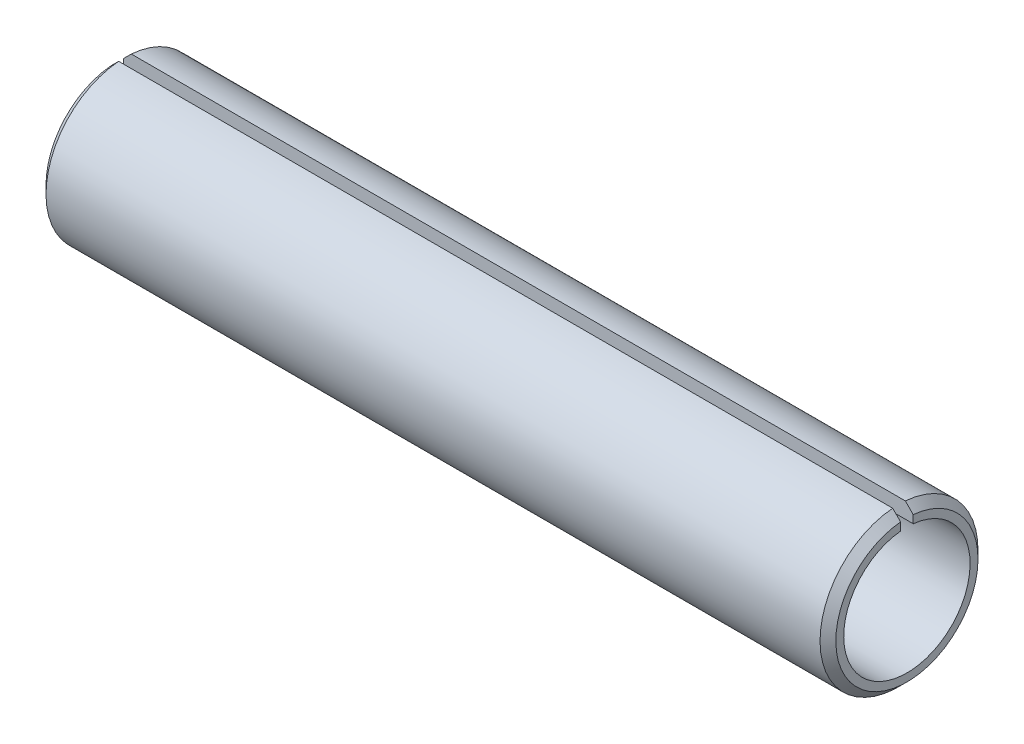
ISO-10303-21;
HEADER;
FILE_DESCRIPTION(('STEP AP214'),'2;1');
FILE_NAME('part.step','',(''),(''),'','','');
FILE_SCHEMA(('AUTOMOTIVE_DESIGN { 1 0 10303 214 1 1 1 1 }'));
ENDSEC;
DATA;
#1=APPLICATION_CONTEXT('core data for automotive mechanical design processes');
#2=APPLICATION_PROTOCOL_DEFINITION('international standard','automotive_design',2000,#1);
#3=PRODUCT_CONTEXT('',#1,'mechanical');
#4=PRODUCT('Part','Part','',(#3));
#5=PRODUCT_RELATED_PRODUCT_CATEGORY('part','',(#4));
#6=PRODUCT_DEFINITION_FORMATION('','',#4);
#7=PRODUCT_DEFINITION_CONTEXT('part definition',#1,'design');
#8=PRODUCT_DEFINITION('design','',#6,#7);
#9=PRODUCT_DEFINITION_SHAPE('','',#8);
#10=(LENGTH_UNIT() NAMED_UNIT(*) SI_UNIT(.MILLI.,.METRE.));
#11=(NAMED_UNIT(*) PLANE_ANGLE_UNIT() SI_UNIT($,.RADIAN.));
#12=(NAMED_UNIT(*) SI_UNIT($,.STERADIAN.) SOLID_ANGLE_UNIT());
#13=UNCERTAINTY_MEASURE_WITH_UNIT(LENGTH_MEASURE(1.E-05),#10,'distance_accuracy_value','');
#14=(GEOMETRIC_REPRESENTATION_CONTEXT(3) GLOBAL_UNCERTAINTY_ASSIGNED_CONTEXT((#13)) GLOBAL_UNIT_ASSIGNED_CONTEXT((#10,
#11,#12)) REPRESENTATION_CONTEXT('',''));
#15=CARTESIAN_POINT('',(0.,0.,0.));
#16=DIRECTION('',(0.,0.,1.));
#17=DIRECTION('',(1.,0.,0.));
#18=AXIS2_PLACEMENT_3D('',#15,#16,#17);
#19=CARTESIAN_POINT('',(0.,0.,0.));
#20=DIRECTION('',(-1.,0.,0.));
#21=DIRECTION('',(0.,0.,1.));
#22=AXIS2_PLACEMENT_3D('',#19,#20,#21);
#23=CYLINDRICAL_SURFACE('',#22,2.);
#24=DIRECTION('',(-1.,0.,0.));
#25=VECTOR('',#24,1.);
#26=CARTESIAN_POINT('',(25.,1.98997487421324,0.2));
#27=LINE('',#26,#25);
#28=CARTESIAN_POINT('',(25.,1.98997487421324,0.2));
#29=VERTEX_POINT('',#28);
#30=CARTESIAN_POINT('',(0.,1.98997487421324,0.2));
#31=VERTEX_POINT('',#30);
#32=EDGE_CURVE('E49',#29,#31,#27,.T.);
#33=ORIENTED_EDGE('',*,*,#32,.F.);
#34=CARTESIAN_POINT('',(25.,0.,0.));
#35=DIRECTION('',(-1.,0.,0.));
#36=DIRECTION('',(0.,0.,1.));
#37=AXIS2_PLACEMENT_3D('',#34,#35,#36);
#38=CIRCLE('',#37,2.);
#39=CARTESIAN_POINT('',(25.,1.98997487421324,-0.2));
#40=VERTEX_POINT('',#39);
#41=EDGE_CURVE('E98',#40,#29,#38,.T.);
#42=ORIENTED_EDGE('',*,*,#41,.F.);
#43=DIRECTION('',(-1.,0.,0.));
#44=VECTOR('',#43,1.);
#45=CARTESIAN_POINT('',(25.,1.98997487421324,-0.2));
#46=LINE('',#45,#44);
#47=CARTESIAN_POINT('',(0.,1.98997487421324,-0.2));
#48=VERTEX_POINT('',#47);
#49=EDGE_CURVE('E102',#40,#48,#46,.T.);
#50=ORIENTED_EDGE('',*,*,#49,.T.);
#51=CARTESIAN_POINT('',(0.,0.,0.));
#52=DIRECTION('',(-1.,0.,0.));
#53=DIRECTION('',(0.,0.,1.));
#54=AXIS2_PLACEMENT_3D('',#51,#52,#53);
#55=CIRCLE('',#54,2.);
#56=EDGE_CURVE('E100',#48,#31,#55,.T.);
#57=ORIENTED_EDGE('',*,*,#56,.T.);
#58=EDGE_LOOP('',(#33,#42,#50,#57));
#59=FACE_BOUND('',#58,.T.);
#60=ADVANCED_FACE('F35',(#59),#23,.F.);
#61=CARTESIAN_POINT('',(25.,2.,0.));
#62=DIRECTION('',(-1.,0.,0.));
#63=DIRECTION('',(0.,0.,1.));
#64=AXIS2_PLACEMENT_3D('',#61,#62,#63);
#65=PLANE('',#64);
#66=DIRECTION('',(0.,-1.,0.));
#67=VECTOR('',#66,1.);
#68=CARTESIAN_POINT('',(25.,2.49198715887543,0.2));
#69=LINE('',#68,#67);
#70=CARTESIAN_POINT('',(25.,2.2410934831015,0.2));
#71=VERTEX_POINT('',#70);
#72=EDGE_CURVE('E84',#71,#29,#69,.T.);
#73=ORIENTED_EDGE('',*,*,#72,.F.);
#74=CARTESIAN_POINT('',(25.,0.,0.));
#75=DIRECTION('',(-1.,0.,0.));
#76=DIRECTION('',(0.,0.,1.));
#77=AXIS2_PLACEMENT_3D('',#74,#75,#76);
#78=CIRCLE('',#77,2.25);
#79=CARTESIAN_POINT('',(25.,2.2410934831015,-0.2));
#80=VERTEX_POINT('',#79);
#81=EDGE_CURVE('E106',#80,#71,#78,.T.);
#82=ORIENTED_EDGE('',*,*,#81,.F.);
#83=DIRECTION('',(0.,-1.,0.));
#84=VECTOR('',#83,1.);
#85=CARTESIAN_POINT('',(25.,2.49198715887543,-0.2));
#86=LINE('',#85,#84);
#87=EDGE_CURVE('E92',#80,#40,#86,.T.);
#88=ORIENTED_EDGE('',*,*,#87,.T.);
#89=ORIENTED_EDGE('',*,*,#41,.T.);
#90=EDGE_LOOP('',(#73,#82,#88,#89));
#91=FACE_BOUND('',#90,.T.);
#92=ADVANCED_FACE('F105',(#91),#65,.F.);
#93=CARTESIAN_POINT('',(25.,0.,0.));
#94=DIRECTION('',(-1.,0.,0.));
#95=DIRECTION('',(0.,0.,1.));
#96=AXIS2_PLACEMENT_3D('',#93,#94,#95);
#97=CONICAL_SURFACE('',#96,2.25,0.785398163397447);
#98=CARTESIAN_POINT('',(24.1508757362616,3.0926640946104,0.2));
#99=CARTESIAN_POINT('',(24.2820338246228,2.96122932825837,0.2));
#100=CARTESIAN_POINT('',(24.4131773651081,2.82978004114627,0.2));
#101=CARTESIAN_POINT('',(24.6754107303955,2.56682804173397,0.2));
#102=CARTESIAN_POINT('',(24.8065005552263,2.43532532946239,0.2));
#103=CARTESIAN_POINT('',(25.068602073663,2.17224189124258,0.2));
#104=CARTESIAN_POINT('',(25.1996137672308,2.04066116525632,0.2));
#105=CARTESIAN_POINT('',(25.4614828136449,1.77734609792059,0.200000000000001));
#106=CARTESIAN_POINT('',(25.5923401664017,1.6456117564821,0.200000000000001));
#107=CARTESIAN_POINT('',(25.7230821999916,1.51376285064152,0.200000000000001));
#108=B_SPLINE_CURVE_WITH_KNOTS('',3,(#98,#99,#100,#101,#102,#103,#104,#105,#106,#107),
.UNSPECIFIED.,.F.,.F.,(4,2,2,2,4),(0.,0.557043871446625,1.11408744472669,1.67113128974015,
2.22817545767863),.UNSPECIFIED.);
#109=CARTESIAN_POINT('',(24.75,2.49198715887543,0.2));
#110=VERTEX_POINT('',#109);
#111=EDGE_CURVE('E87',#110,#71,#108,.T.);
#112=ORIENTED_EDGE('',*,*,#111,.F.);
#113=CARTESIAN_POINT('',(24.75,0.,0.));
#114=DIRECTION('',(-1.,0.,0.));
#115=DIRECTION('',(0.,0.,1.));
#116=AXIS2_PLACEMENT_3D('',#113,#114,#115);
#117=CIRCLE('',#116,2.5);
#118=CARTESIAN_POINT('',(24.75,2.49198715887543,-0.2));
#119=VERTEX_POINT('',#118);
#120=EDGE_CURVE('E108',#119,#110,#117,.T.);
#121=ORIENTED_EDGE('',*,*,#120,.F.);
#122=CARTESIAN_POINT('',(24.1508757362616,3.0926640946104,-0.2));
#123=CARTESIAN_POINT('',(24.2820338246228,2.96122932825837,-0.2));
#124=CARTESIAN_POINT('',(24.4131773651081,2.82978004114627,-0.2));
#125=CARTESIAN_POINT('',(24.6754107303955,2.56682804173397,-0.2));
#126=CARTESIAN_POINT('',(24.8065005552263,2.43532532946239,-0.2));
#127=CARTESIAN_POINT('',(25.068602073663,2.17224189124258,-0.2));
#128=CARTESIAN_POINT('',(25.1996137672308,2.04066116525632,-0.2));
#129=CARTESIAN_POINT('',(25.4614828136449,1.77734609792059,-0.200000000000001));
#130=CARTESIAN_POINT('',(25.5923401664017,1.6456117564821,-0.200000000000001));
#131=CARTESIAN_POINT('',(25.7230821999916,1.51376285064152,-0.200000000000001));
#132=B_SPLINE_CURVE_WITH_KNOTS('',3,(#122,#123,#124,#125,#126,#127,#128,#129,#130,#131),
.UNSPECIFIED.,.F.,.F.,(4,2,2,2,4),(0.,0.557043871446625,1.11408744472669,1.67113128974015,
2.22817545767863),.UNSPECIFIED.);
#133=EDGE_CURVE('E156',#119,#80,#132,.T.);
#134=ORIENTED_EDGE('',*,*,#133,.T.);
#135=ORIENTED_EDGE('',*,*,#81,.T.);
#136=EDGE_LOOP('',(#112,#121,#134,#135));
#137=FACE_BOUND('',#136,.T.);
#138=ADVANCED_FACE('F132',(#137),#97,.T.);
#139=CARTESIAN_POINT('',(0.,0.,0.));
#140=DIRECTION('',(-1.,0.,0.));
#141=DIRECTION('',(0.,0.,1.));
#142=AXIS2_PLACEMENT_3D('',#139,#140,#141);
#143=CYLINDRICAL_SURFACE('',#142,2.5);
#144=DIRECTION('',(-1.,0.,0.));
#145=VECTOR('',#144,1.);
#146=CARTESIAN_POINT('',(25.,2.49198715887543,0.2));
#147=LINE('',#146,#145);
#148=CARTESIAN_POINT('',(0.25,2.49198715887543,0.2));
#149=VERTEX_POINT('',#148);
#150=EDGE_CURVE('E101',#110,#149,#147,.T.);
#151=ORIENTED_EDGE('',*,*,#150,.T.);
#152=CARTESIAN_POINT('',(0.249999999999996,0.,0.));
#153=DIRECTION('',(-1.,0.,0.));
#154=DIRECTION('',(0.,0.,1.));
#155=AXIS2_PLACEMENT_3D('',#152,#153,#154);
#156=CIRCLE('',#155,2.5);
#157=CARTESIAN_POINT('',(0.25,2.49198715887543,-0.2));
#158=VERTEX_POINT('',#157);
#159=EDGE_CURVE('E113',#158,#149,#156,.T.);
#160=ORIENTED_EDGE('',*,*,#159,.F.);
#161=DIRECTION('',(-1.,0.,0.));
#162=VECTOR('',#161,1.);
#163=CARTESIAN_POINT('',(25.,2.49198715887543,-0.2));
#164=LINE('',#163,#162);
#165=EDGE_CURVE('E169',#119,#158,#164,.T.);
#166=ORIENTED_EDGE('',*,*,#165,.F.);
#167=ORIENTED_EDGE('',*,*,#120,.T.);
#168=EDGE_LOOP('',(#151,#160,#166,#167));
#169=FACE_BOUND('',#168,.T.);
#170=ADVANCED_FACE('F148',(#169),#143,.T.);
#171=CARTESIAN_POINT('',(0.249999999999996,0.,0.));
#172=DIRECTION('',(1.,0.,0.));
#173=DIRECTION('',(0.,0.,-1.));
#174=AXIS2_PLACEMENT_3D('',#171,#172,#173);
#175=CONICAL_SURFACE('',#174,2.5,0.785398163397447);
#176=CARTESIAN_POINT('',(-0.723082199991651,1.51376285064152,0.200000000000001));
#177=CARTESIAN_POINT('',(-0.592340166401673,1.6456117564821,0.200000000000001));
#178=CARTESIAN_POINT('',(-0.461482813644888,1.77734609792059,0.200000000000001));
#179=CARTESIAN_POINT('',(-0.199613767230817,2.04066116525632,0.2));
#180=CARTESIAN_POINT('',(-0.0686020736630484,2.17224189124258,0.2));
#181=CARTESIAN_POINT('',(0.193499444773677,2.43532532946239,0.2));
#182=CARTESIAN_POINT('',(0.324589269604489,2.56682804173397,0.2));
#183=CARTESIAN_POINT('',(0.586822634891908,2.82978004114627,0.2));
#184=CARTESIAN_POINT('',(0.717966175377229,2.96122932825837,0.2));
#185=CARTESIAN_POINT('',(0.849124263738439,3.0926640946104,0.2));
#186=B_SPLINE_CURVE_WITH_KNOTS('',3,(#176,#177,#178,#179,#180,#181,#182,#183,#184,#185),
.UNSPECIFIED.,.F.,.F.,(4,2,2,2,4),(0.,0.557044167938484,1.11408801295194,1.67113158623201,
2.22817545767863),.UNSPECIFIED.);
#187=CARTESIAN_POINT('',(0.,2.2410934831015,0.2));
#188=VERTEX_POINT('',#187);
#189=EDGE_CURVE('E126',#188,#149,#186,.T.);
#190=ORIENTED_EDGE('',*,*,#189,.F.);
#191=CARTESIAN_POINT('',(0.,0.,0.));
#192=DIRECTION('',(-1.,0.,0.));
#193=DIRECTION('',(0.,0.,1.));
#194=AXIS2_PLACEMENT_3D('',#191,#192,#193);
#195=CIRCLE('',#194,2.25);
#196=CARTESIAN_POINT('',(0.,2.2410934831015,-0.2));
#197=VERTEX_POINT('',#196);
#198=EDGE_CURVE('E116',#197,#188,#195,.T.);
#199=ORIENTED_EDGE('',*,*,#198,.F.);
#200=CARTESIAN_POINT('',(-0.723082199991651,1.51376285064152,-0.200000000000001));
#201=CARTESIAN_POINT('',(-0.592340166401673,1.6456117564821,-0.200000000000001));
#202=CARTESIAN_POINT('',(-0.461482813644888,1.77734609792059,-0.200000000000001));
#203=CARTESIAN_POINT('',(-0.199613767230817,2.04066116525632,-0.2));
#204=CARTESIAN_POINT('',(-0.0686020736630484,2.17224189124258,-0.2));
#205=CARTESIAN_POINT('',(0.193499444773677,2.43532532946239,-0.2));
#206=CARTESIAN_POINT('',(0.324589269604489,2.56682804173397,-0.2));
#207=CARTESIAN_POINT('',(0.586822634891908,2.82978004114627,-0.2));
#208=CARTESIAN_POINT('',(0.717966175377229,2.96122932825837,-0.2));
#209=CARTESIAN_POINT('',(0.849124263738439,3.0926640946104,-0.2));
#210=B_SPLINE_CURVE_WITH_KNOTS('',3,(#200,#201,#202,#203,#204,#205,#206,#207,#208,#209),
.UNSPECIFIED.,.F.,.F.,(4,2,2,2,4),(0.,0.557044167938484,1.11408801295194,1.67113158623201,
2.22817545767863),.UNSPECIFIED.);
#211=EDGE_CURVE('E56',#197,#158,#210,.T.);
#212=ORIENTED_EDGE('',*,*,#211,.T.);
#213=ORIENTED_EDGE('',*,*,#159,.T.);
#214=EDGE_LOOP('',(#190,#199,#212,#213));
#215=FACE_BOUND('',#214,.T.);
#216=ADVANCED_FACE('F144',(#215),#175,.T.);
#217=CARTESIAN_POINT('',(0.,2.,0.));
#218=DIRECTION('',(-1.,0.,0.));
#219=DIRECTION('',(0.,0.,1.));
#220=AXIS2_PLACEMENT_3D('',#217,#218,#219);
#221=PLANE('',#220);
#222=ORIENTED_EDGE('',*,*,#198,.T.);
#223=DIRECTION('',(0.,-1.,0.));
#224=VECTOR('',#223,1.);
#225=CARTESIAN_POINT('',(0.,2.,0.2));
#226=LINE('',#225,#224);
#227=EDGE_CURVE('E11',#188,#31,#226,.T.);
#228=ORIENTED_EDGE('',*,*,#227,.T.);
#229=ORIENTED_EDGE('',*,*,#56,.F.);
#230=DIRECTION('',(0.,-1.,0.));
#231=VECTOR('',#230,1.);
#232=CARTESIAN_POINT('',(0.,2.,-0.2));
#233=LINE('',#232,#231);
#234=EDGE_CURVE('E42',#197,#48,#233,.T.);
#235=ORIENTED_EDGE('',*,*,#234,.F.);
#236=EDGE_LOOP('',(#222,#228,#229,#235));
#237=FACE_BOUND('',#236,.T.);
#238=ADVANCED_FACE('F141',(#237),#221,.T.);
#239=CARTESIAN_POINT('',(25.,2.49198715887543,-0.2));
#240=DIRECTION('',(0.,0.,-1.));
#241=DIRECTION('',(0.,1.,0.));
#242=AXIS2_PLACEMENT_3D('',#239,#240,#241);
#243=PLANE('',#242);
#244=ORIENTED_EDGE('',*,*,#165,.T.);
#245=ORIENTED_EDGE('',*,*,#211,.F.);
#246=ORIENTED_EDGE('',*,*,#234,.T.);
#247=ORIENTED_EDGE('',*,*,#49,.F.);
#248=ORIENTED_EDGE('',*,*,#87,.F.);
#249=ORIENTED_EDGE('',*,*,#133,.F.);
#250=EDGE_LOOP('',(#244,#245,#246,#247,#248,#249));
#251=FACE_BOUND('',#250,.T.);
#252=ADVANCED_FACE('F139',(#251),#243,.F.);
#253=CARTESIAN_POINT('',(25.,2.49198715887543,0.2));
#254=DIRECTION('',(0.,0.,-1.));
#255=DIRECTION('',(0.,1.,0.));
#256=AXIS2_PLACEMENT_3D('',#253,#254,#255);
#257=PLANE('',#256);
#258=ORIENTED_EDGE('',*,*,#111,.T.);
#259=ORIENTED_EDGE('',*,*,#72,.T.);
#260=ORIENTED_EDGE('',*,*,#32,.T.);
#261=ORIENTED_EDGE('',*,*,#227,.F.);
#262=ORIENTED_EDGE('',*,*,#189,.T.);
#263=ORIENTED_EDGE('',*,*,#150,.F.);
#264=EDGE_LOOP('',(#258,#259,#260,#261,#262,#263));
#265=FACE_BOUND('',#264,.T.);
#266=ADVANCED_FACE('F85',(#265),#257,.T.);
#267=CLOSED_SHELL('',(#60,#92,#138,#170,#216,#238,#252,#266));
#268=MANIFOLD_SOLID_BREP('B2',#267);
#269=ADVANCED_BREP_SHAPE_REPRESENTATION('',(#18,#268),#14);
#270=SHAPE_DEFINITION_REPRESENTATION(#9,#269);
ENDSEC;
END-ISO-10303-21;
